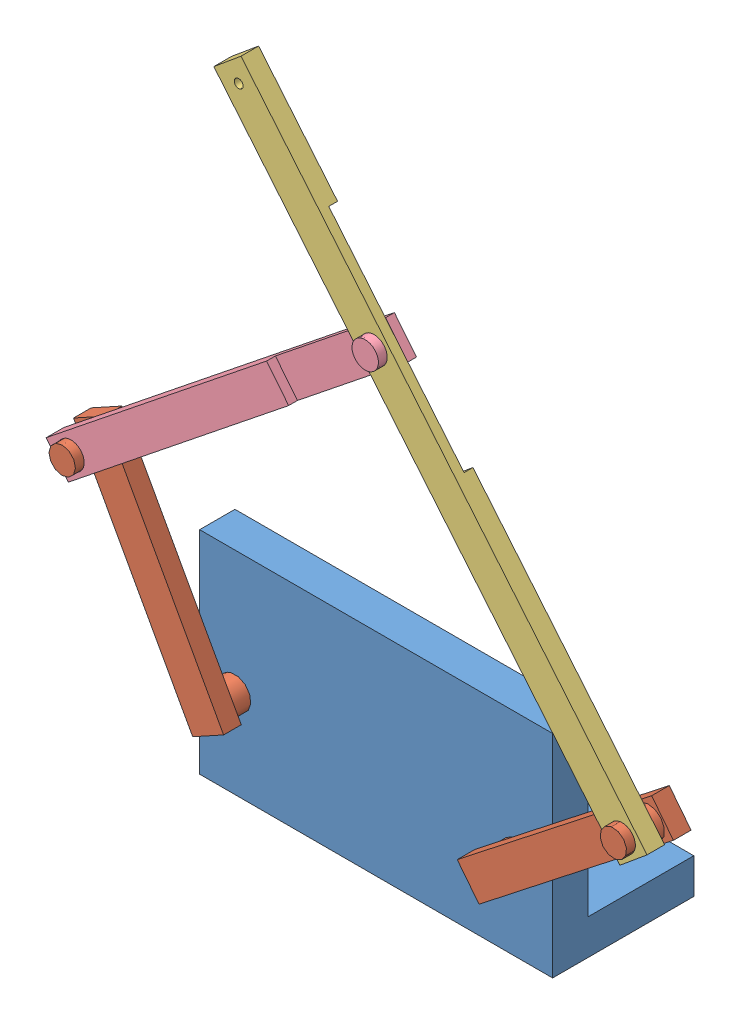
SolidWorks assembly Pp2dofmech.SLDASM, configuration ﾃﾞﾌｫﾙﾄ (file format 4400). Lengths in mm.
Overall size (340.44 399.04 120).
5 component instances, 4 part files, 9 mates.
Components (placement in the parent):
- Base-1: Base.SLDPRT [ﾃﾞﾌｫﾙﾄ] at (-149.5182 -63.8091 20) size (200 120 80)
- Drivinglink-1: Drivinglink.SLDPRT [ﾃﾞﾌｫﾙﾄ] at (-133.4537 -27.3926 60) x (-0.482398 0.875952 0) z (0 0 -1) size (140 20 70)
- Drivinglink-2: Drivinglink.SLDPRT [ﾃﾞﾌｫﾙﾄ] at (16.4416 -12.7261 60) x (0.786758 0.617262 0) z (0 0 -1) size (140 20 70)
- Outputlink-1: Outputlink.SLDPRT [ﾃﾞﾌｫﾙﾄ] at (123.5926 45.5681 75) x (-0.639104 0.769121 0) z (0 0 -1) size (360 20 10)
- Coupler-1: Coupler.SLDPRT [ﾃﾞﾌｫﾙﾄ] at (-188.958 77.2484 65) x (0.780436 0.625235 0) z (0 0 1) size (240 20 15)
Mates (geometry in assembly coordinates):
- 同心円1: concentric aligned: cylinder of Base-1 through (-129.5182 -13.8091 -40) axis (0 0 1) radius 7.5; cylinder of Drivinglink-1 through (-129.5182 -13.8091 10) axis (0 0 1) radius 7.5
- 一致1: coincident anti-aligned: plane of Base-1 through (-149.5182 56.1909 40) normal (0 0 1); plane of Drivinglink-1 through (-129.5182 -13.8091 40) normal (0 0 -1)
- 同心円2: concentric aligned: cylinder of Drivinglink-2 through (30.4818 -14.421 10) axis (0 0 1) radius 7.5; cylinder of Base-1 through (30.4818 -14.421 -40) axis (0 0 1) radius 7.5
- 一致2: coincident anti-aligned: plane of Base-1 through (-149.5182 56.1909 40) normal (0 0 1); plane of Drivinglink-2 through (30.4818 -14.421 40) normal (0 0 -1)
- 同心円3: concentric anti-aligned: cylinder of Drivinglink-1 through (-187.406 91.3051 80) axis (0 0 -1) radius 7.5; cylinder of Coupler-1 through (-187.406 91.3051 65) axis (0 0 1) radius 7.5
- 一致3: coincident anti-aligned: plane of Drivinglink-1 through (-187.406 91.3051 65) normal (0 0 1); plane of Coupler-1 through (-201.4627 92.8571 65) normal (0 0 -1)
- 同心円4: concentric aligned: cylinder of Drivinglink-2 through (124.8928 59.6504 80) axis (0 0 -1) radius 7.5; cylinder of Outputlink-1 through (124.8928 59.6504 75) axis (0 0 -1) radius 7.5
- 一致4: coincident anti-aligned: plane of Drivinglink-2 through (124.8928 59.6504 65) normal (0 0 1); plane of Outputlink-1 through (138.975 58.3502 65) normal (0 0 -1)
- 同心円5: concentric aligned: cylinder of Outputlink-1 through (-15.71 228.8569 75) axis (0 0 -1) radius 7.5; cylinder of Coupler-1 through (-15.71 228.8569 80) axis (0 0 -1) radius 7.5
